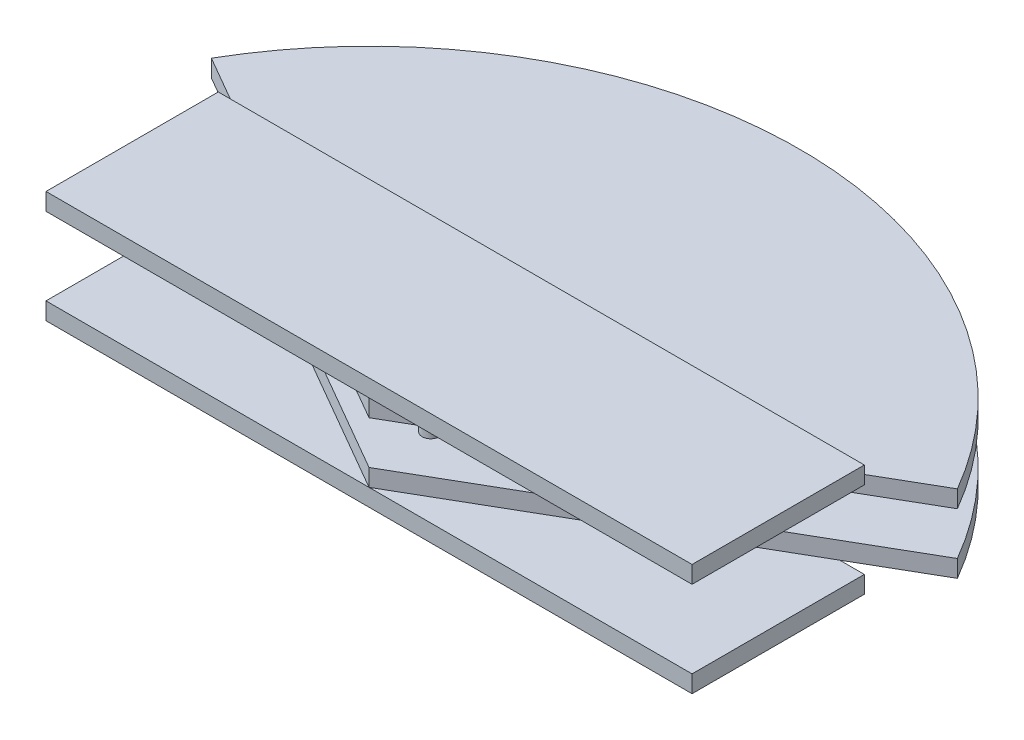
ISO-10303-21;
HEADER;
FILE_DESCRIPTION(('STEP AP214'),'2;1');
FILE_NAME('part.step','',(''),(''),'','','');
FILE_SCHEMA(('AUTOMOTIVE_DESIGN { 1 0 10303 214 1 1 1 1 }'));
ENDSEC;
DATA;
#1=APPLICATION_CONTEXT('core data for automotive mechanical design processes');
#2=APPLICATION_PROTOCOL_DEFINITION('international standard','automotive_design',2000,#1);
#3=PRODUCT_CONTEXT('',#1,'mechanical');
#4=PRODUCT('Part','Part','',(#3));
#5=PRODUCT_RELATED_PRODUCT_CATEGORY('part','',(#4));
#6=PRODUCT_DEFINITION_FORMATION('','',#4);
#7=PRODUCT_DEFINITION_CONTEXT('part definition',#1,'design');
#8=PRODUCT_DEFINITION('design','',#6,#7);
#9=PRODUCT_DEFINITION_SHAPE('','',#8);
#10=(LENGTH_UNIT() NAMED_UNIT(*) SI_UNIT(.MILLI.,.METRE.));
#11=(NAMED_UNIT(*) PLANE_ANGLE_UNIT() SI_UNIT($,.RADIAN.));
#12=(NAMED_UNIT(*) SI_UNIT($,.STERADIAN.) SOLID_ANGLE_UNIT());
#13=UNCERTAINTY_MEASURE_WITH_UNIT(LENGTH_MEASURE(1.E-05),#10,'distance_accuracy_value','');
#14=(GEOMETRIC_REPRESENTATION_CONTEXT(3) GLOBAL_UNCERTAINTY_ASSIGNED_CONTEXT((#13)) GLOBAL_UNIT_ASSIGNED_CONTEXT((#10,
#11,#12)) REPRESENTATION_CONTEXT('',''));
#15=CARTESIAN_POINT('',(0.,0.,0.));
#16=DIRECTION('',(0.,0.,1.));
#17=DIRECTION('',(1.,0.,0.));
#18=AXIS2_PLACEMENT_3D('',#15,#16,#17);
#19=CARTESIAN_POINT('',(0.,8.,0.));
#20=DIRECTION('',(0.499999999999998,0.,-0.86602540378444));
#21=DIRECTION('',(-0.86602540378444,0.,-0.499999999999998));
#22=AXIS2_PLACEMENT_3D('',#19,#20,#21);
#23=PLANE('',#22);
#24=DIRECTION('',(0.86602540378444,0.,0.499999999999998));
#25=VECTOR('',#24,1.);
#26=CARTESIAN_POINT('',(0.,0.,0.));
#27=LINE('',#26,#25);
#28=CARTESIAN_POINT('',(-173.205080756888,0.,-99.9999999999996));
#29=VERTEX_POINT('',#28);
#30=CARTESIAN_POINT('',(0.,0.,0.));
#31=VERTEX_POINT('',#30);
#32=EDGE_CURVE('E274',#29,#31,#27,.T.);
#33=ORIENTED_EDGE('',*,*,#32,.T.);
#34=DIRECTION('',(0.,-1.,0.));
#35=VECTOR('',#34,1.);
#36=CARTESIAN_POINT('',(0.,8.,0.));
#37=LINE('',#36,#35);
#38=CARTESIAN_POINT('',(0.,8.,0.));
#39=VERTEX_POINT('',#38);
#40=EDGE_CURVE('E303',#39,#31,#37,.T.);
#41=ORIENTED_EDGE('',*,*,#40,.F.);
#42=DIRECTION('',(0.86602540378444,0.,0.499999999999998));
#43=VECTOR('',#42,1.);
#44=CARTESIAN_POINT('',(0.,8.,0.));
#45=LINE('',#44,#43);
#46=CARTESIAN_POINT('',(-138.564064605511,8.,-80.));
#47=VERTEX_POINT('',#46);
#48=EDGE_CURVE('E279',#47,#39,#45,.T.);
#49=ORIENTED_EDGE('',*,*,#48,.F.);
#50=CARTESIAN_POINT('',(-173.205080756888,8.,-99.9999999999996));
#51=VERTEX_POINT('',#50);
#52=EDGE_CURVE('E275',#51,#47,#45,.T.);
#53=ORIENTED_EDGE('',*,*,#52,.F.);
#54=DIRECTION('',(0.,-1.,0.));
#55=VECTOR('',#54,1.);
#56=CARTESIAN_POINT('',(-173.205080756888,8.,-99.9999999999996));
#57=LINE('',#56,#55);
#58=EDGE_CURVE('E287',#51,#29,#57,.T.);
#59=ORIENTED_EDGE('',*,*,#58,.T.);
#60=EDGE_LOOP('',(#33,#41,#49,#53,#59));
#61=FACE_BOUND('',#60,.T.);
#62=ADVANCED_FACE('F41',(#61),#23,.F.);
#63=CARTESIAN_POINT('',(0.,8.,0.));
#64=DIRECTION('',(-0.499999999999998,0.,-0.86602540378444));
#65=DIRECTION('',(-0.86602540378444,0.,0.499999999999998));
#66=AXIS2_PLACEMENT_3D('',#63,#64,#65);
#67=PLANE('',#66);
#68=DIRECTION('',(0.86602540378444,0.,-0.499999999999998));
#69=VECTOR('',#68,1.);
#70=CARTESIAN_POINT('',(0.,0.,0.));
#71=LINE('',#70,#69);
#72=CARTESIAN_POINT('',(173.205080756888,0.,-99.9999999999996));
#73=VERTEX_POINT('',#72);
#74=EDGE_CURVE('E291',#31,#73,#71,.T.);
#75=ORIENTED_EDGE('',*,*,#74,.T.);
#76=DIRECTION('',(0.,-1.,0.));
#77=VECTOR('',#76,1.);
#78=CARTESIAN_POINT('',(173.205080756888,8.,-99.9999999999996));
#79=LINE('',#78,#77);
#80=CARTESIAN_POINT('',(173.205080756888,8.,-99.9999999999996));
#81=VERTEX_POINT('',#80);
#82=EDGE_CURVE('E300',#81,#73,#79,.T.);
#83=ORIENTED_EDGE('',*,*,#82,.F.);
#84=DIRECTION('',(0.86602540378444,0.,-0.499999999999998));
#85=VECTOR('',#84,1.);
#86=CARTESIAN_POINT('',(0.,8.,0.));
#87=LINE('',#86,#85);
#88=CARTESIAN_POINT('',(138.564064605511,8.,-80.));
#89=VERTEX_POINT('',#88);
#90=EDGE_CURVE('E278',#89,#81,#87,.T.);
#91=ORIENTED_EDGE('',*,*,#90,.F.);
#92=EDGE_CURVE('E280',#39,#89,#87,.T.);
#93=ORIENTED_EDGE('',*,*,#92,.F.);
#94=ORIENTED_EDGE('',*,*,#40,.T.);
#95=EDGE_LOOP('',(#75,#83,#91,#93,#94));
#96=FACE_BOUND('',#95,.T.);
#97=ADVANCED_FACE('F339',(#96),#67,.F.);
#98=CARTESIAN_POINT('',(0.,8.,0.));
#99=DIRECTION('',(0.,-1.,0.));
#100=DIRECTION('',(0.,0.,-1.));
#101=AXIS2_PLACEMENT_3D('',#98,#99,#100);
#102=CYLINDRICAL_SURFACE('',#101,200.);
#103=CARTESIAN_POINT('',(0.,0.,0.));
#104=DIRECTION('',(0.,1.,0.));
#105=DIRECTION('',(0.,0.,1.));
#106=AXIS2_PLACEMENT_3D('',#103,#104,#105);
#107=CIRCLE('',#106,200.);
#108=EDGE_CURVE('E294',#73,#29,#107,.T.);
#109=ORIENTED_EDGE('',*,*,#108,.T.);
#110=ORIENTED_EDGE('',*,*,#58,.F.);
#111=CARTESIAN_POINT('',(0.,8.,0.));
#112=DIRECTION('',(0.,1.,0.));
#113=DIRECTION('',(0.,0.,1.));
#114=AXIS2_PLACEMENT_3D('',#111,#112,#113);
#115=CIRCLE('',#114,200.);
#116=EDGE_CURVE('E284',#81,#51,#115,.T.);
#117=ORIENTED_EDGE('',*,*,#116,.F.);
#118=ORIENTED_EDGE('',*,*,#82,.T.);
#119=EDGE_LOOP('',(#109,#110,#117,#118));
#120=FACE_BOUND('',#119,.T.);
#121=ADVANCED_FACE('F350',(#120),#102,.T.);
#122=CARTESIAN_POINT('',(0.,8.,0.));
#123=DIRECTION('',(0.,1.,0.));
#124=DIRECTION('',(0.,0.,1.));
#125=AXIS2_PLACEMENT_3D('',#122,#123,#124);
#126=PLANE('',#125);
#127=DIRECTION('',(-1.,0.,0.));
#128=VECTOR('',#127,1.);
#129=CARTESIAN_POINT('',(-150.,8.,-80.));
#130=LINE('',#129,#128);
#131=EDGE_CURVE('E65',#89,#47,#130,.T.);
#132=ORIENTED_EDGE('',*,*,#131,.F.);
#133=ORIENTED_EDGE('',*,*,#90,.T.);
#134=ORIENTED_EDGE('',*,*,#116,.T.);
#135=ORIENTED_EDGE('',*,*,#52,.T.);
#136=EDGE_LOOP('',(#132,#133,#134,#135));
#137=FACE_BOUND('',#136,.T.);
#138=ADVANCED_FACE('F351',(#137),#126,.T.);
#139=CARTESIAN_POINT('',(0.,0.,0.));
#140=DIRECTION('',(0.,1.,0.));
#141=DIRECTION('',(0.,0.,1.));
#142=AXIS2_PLACEMENT_3D('',#139,#140,#141);
#143=PLANE('',#142);
#144=CARTESIAN_POINT('',(0.,0.,-28.6914040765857));
#145=DIRECTION('',(0.,1.,0.));
#146=DIRECTION('',(0.,0.,1.));
#147=AXIS2_PLACEMENT_3D('',#144,#145,#146);
#148=CIRCLE('',#147,4.);
#149=CARTESIAN_POINT('',(0.,0.,-24.6914040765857));
#150=VERTEX_POINT('',#149);
#151=EDGE_CURVE('E44',#150,#150,#148,.F.);
#152=ORIENTED_EDGE('',*,*,#151,.F.);
#153=EDGE_LOOP('',(#152));
#154=FACE_BOUND('',#153,.T.);
#155=ORIENTED_EDGE('',*,*,#32,.F.);
#156=ORIENTED_EDGE('',*,*,#108,.F.);
#157=ORIENTED_EDGE('',*,*,#74,.F.);
#158=EDGE_LOOP('',(#155,#156,#157));
#159=FACE_BOUND('',#158,.T.);
#160=ADVANCED_FACE('F347',(#154,#159),#143,.F.);
#161=CARTESIAN_POINT('',(0.,8.,0.));
#162=DIRECTION('',(0.,-1.,0.));
#163=DIRECTION('',(0.,0.,-1.));
#164=AXIS2_PLACEMENT_3D('',#161,#162,#163);
#165=PLANE('',#164);
#166=CARTESIAN_POINT('',(-150.,8.,-80.));
#167=VERTEX_POINT('',#166);
#168=EDGE_CURVE('E255',#47,#167,#130,.T.);
#169=ORIENTED_EDGE('',*,*,#168,.F.);
#170=ORIENTED_EDGE('',*,*,#48,.T.);
#171=DIRECTION('',(1.,0.,0.));
#172=VECTOR('',#171,1.);
#173=CARTESIAN_POINT('',(-150.,8.,0.));
#174=LINE('',#173,#172);
#175=CARTESIAN_POINT('',(-150.,8.,0.));
#176=VERTEX_POINT('',#175);
#177=EDGE_CURVE('E248',#176,#39,#174,.T.);
#178=ORIENTED_EDGE('',*,*,#177,.F.);
#179=DIRECTION('',(0.,0.,1.));
#180=VECTOR('',#179,1.);
#181=CARTESIAN_POINT('',(-150.,8.,0.));
#182=LINE('',#181,#180);
#183=EDGE_CURVE('E228',#167,#176,#182,.T.);
#184=ORIENTED_EDGE('',*,*,#183,.F.);
#185=EDGE_LOOP('',(#169,#170,#178,#184));
#186=FACE_BOUND('',#185,.T.);
#187=ADVANCED_FACE('F324',(#186),#165,.T.);
#188=CARTESIAN_POINT('',(-150.,16.,0.));
#189=DIRECTION('',(1.,0.,0.));
#190=DIRECTION('',(0.,0.,-1.));
#191=AXIS2_PLACEMENT_3D('',#188,#189,#190);
#192=PLANE('',#191);
#193=ORIENTED_EDGE('',*,*,#183,.T.);
#194=DIRECTION('',(0.,-1.,0.));
#195=VECTOR('',#194,1.);
#196=CARTESIAN_POINT('',(-150.,16.,0.));
#197=LINE('',#196,#195);
#198=CARTESIAN_POINT('',(-150.,16.,0.));
#199=VERTEX_POINT('',#198);
#200=EDGE_CURVE('E270',#199,#176,#197,.T.);
#201=ORIENTED_EDGE('',*,*,#200,.F.);
#202=DIRECTION('',(0.,0.,1.));
#203=VECTOR('',#202,1.);
#204=CARTESIAN_POINT('',(-150.,16.,0.));
#205=LINE('',#204,#203);
#206=CARTESIAN_POINT('',(-150.,16.,-80.));
#207=VERTEX_POINT('',#206);
#208=EDGE_CURVE('E229',#207,#199,#205,.T.);
#209=ORIENTED_EDGE('',*,*,#208,.F.);
#210=DIRECTION('',(0.,-1.,0.));
#211=VECTOR('',#210,1.);
#212=CARTESIAN_POINT('',(-150.,16.,-80.));
#213=LINE('',#212,#211);
#214=EDGE_CURVE('E243',#207,#167,#213,.T.);
#215=ORIENTED_EDGE('',*,*,#214,.T.);
#216=EDGE_LOOP('',(#193,#201,#209,#215));
#217=FACE_BOUND('',#216,.T.);
#218=ADVANCED_FACE('F322',(#217),#192,.F.);
#219=CARTESIAN_POINT('',(-150.,16.,0.));
#220=DIRECTION('',(0.,0.,-1.));
#221=DIRECTION('',(-1.,0.,0.));
#222=AXIS2_PLACEMENT_3D('',#219,#220,#221);
#223=PLANE('',#222);
#224=ORIENTED_EDGE('',*,*,#177,.T.);
#225=CARTESIAN_POINT('',(150.,8.,0.));
#226=VERTEX_POINT('',#225);
#227=EDGE_CURVE('E247',#39,#226,#174,.T.);
#228=ORIENTED_EDGE('',*,*,#227,.T.);
#229=DIRECTION('',(0.,-1.,0.));
#230=VECTOR('',#229,1.);
#231=CARTESIAN_POINT('',(150.,16.,0.));
#232=LINE('',#231,#230);
#233=CARTESIAN_POINT('',(150.,16.,0.));
#234=VERTEX_POINT('',#233);
#235=EDGE_CURVE('E266',#234,#226,#232,.T.);
#236=ORIENTED_EDGE('',*,*,#235,.F.);
#237=DIRECTION('',(1.,0.,0.));
#238=VECTOR('',#237,1.);
#239=CARTESIAN_POINT('',(-150.,16.,0.));
#240=LINE('',#239,#238);
#241=EDGE_CURVE('E233',#199,#234,#240,.T.);
#242=ORIENTED_EDGE('',*,*,#241,.F.);
#243=ORIENTED_EDGE('',*,*,#200,.T.);
#244=EDGE_LOOP('',(#224,#228,#236,#242,#243));
#245=FACE_BOUND('',#244,.T.);
#246=ADVANCED_FACE('F328',(#245),#223,.F.);
#247=CARTESIAN_POINT('',(150.,16.,0.));
#248=DIRECTION('',(-1.,0.,0.));
#249=DIRECTION('',(0.,0.,1.));
#250=AXIS2_PLACEMENT_3D('',#247,#248,#249);
#251=PLANE('',#250);
#252=DIRECTION('',(0.,0.,-1.));
#253=VECTOR('',#252,1.);
#254=CARTESIAN_POINT('',(150.,8.,0.));
#255=LINE('',#254,#253);
#256=CARTESIAN_POINT('',(150.,8.,-80.));
#257=VERTEX_POINT('',#256);
#258=EDGE_CURVE('E252',#226,#257,#255,.T.);
#259=ORIENTED_EDGE('',*,*,#258,.T.);
#260=DIRECTION('',(0.,-1.,0.));
#261=VECTOR('',#260,1.);
#262=CARTESIAN_POINT('',(150.,16.,-80.));
#263=LINE('',#262,#261);
#264=CARTESIAN_POINT('',(150.,16.,-80.));
#265=VERTEX_POINT('',#264);
#266=EDGE_CURVE('E262',#265,#257,#263,.T.);
#267=ORIENTED_EDGE('',*,*,#266,.F.);
#268=DIRECTION('',(0.,0.,-1.));
#269=VECTOR('',#268,1.);
#270=CARTESIAN_POINT('',(150.,16.,0.));
#271=LINE('',#270,#269);
#272=EDGE_CURVE('E237',#234,#265,#271,.T.);
#273=ORIENTED_EDGE('',*,*,#272,.F.);
#274=ORIENTED_EDGE('',*,*,#235,.T.);
#275=EDGE_LOOP('',(#259,#267,#273,#274));
#276=FACE_BOUND('',#275,.T.);
#277=ADVANCED_FACE('F414',(#276),#251,.F.);
#278=CARTESIAN_POINT('',(-150.,16.,-80.));
#279=DIRECTION('',(0.,0.,1.));
#280=DIRECTION('',(1.,0.,0.));
#281=AXIS2_PLACEMENT_3D('',#278,#279,#280);
#282=PLANE('',#281);
#283=EDGE_CURVE('E234',#257,#89,#130,.T.);
#284=ORIENTED_EDGE('',*,*,#283,.T.);
#285=ORIENTED_EDGE('',*,*,#131,.T.);
#286=ORIENTED_EDGE('',*,*,#168,.T.);
#287=ORIENTED_EDGE('',*,*,#214,.F.);
#288=DIRECTION('',(-1.,0.,0.));
#289=VECTOR('',#288,1.);
#290=CARTESIAN_POINT('',(-150.,16.,-80.));
#291=LINE('',#290,#289);
#292=EDGE_CURVE('E240',#265,#207,#291,.T.);
#293=ORIENTED_EDGE('',*,*,#292,.F.);
#294=ORIENTED_EDGE('',*,*,#266,.T.);
#295=EDGE_LOOP('',(#284,#285,#286,#287,#293,#294));
#296=FACE_BOUND('',#295,.T.);
#297=ADVANCED_FACE('F315',(#296),#282,.F.);
#298=CARTESIAN_POINT('',(0.,16.,0.));
#299=DIRECTION('',(0.,-1.,0.));
#300=DIRECTION('',(0.,0.,-1.));
#301=AXIS2_PLACEMENT_3D('',#298,#299,#300);
#302=PLANE('',#301);
#303=ORIENTED_EDGE('',*,*,#208,.T.);
#304=ORIENTED_EDGE('',*,*,#241,.T.);
#305=ORIENTED_EDGE('',*,*,#272,.T.);
#306=ORIENTED_EDGE('',*,*,#292,.T.);
#307=EDGE_LOOP('',(#303,#304,#305,#306));
#308=FACE_BOUND('',#307,.T.);
#309=ADVANCED_FACE('F332',(#308),#302,.F.);
#310=ORIENTED_EDGE('',*,*,#227,.F.);
#311=ORIENTED_EDGE('',*,*,#92,.T.);
#312=ORIENTED_EDGE('',*,*,#283,.F.);
#313=ORIENTED_EDGE('',*,*,#258,.F.);
#314=EDGE_LOOP('',(#310,#311,#312,#313));
#315=FACE_BOUND('',#314,.T.);
#316=ADVANCED_FACE('F338',(#315),#165,.T.);
#317=CARTESIAN_POINT('',(0.,-20.,-28.6914040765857));
#318=DIRECTION('',(0.,1.,0.));
#319=DIRECTION('',(0.,0.,1.));
#320=AXIS2_PLACEMENT_3D('',#317,#318,#319);
#321=CYLINDRICAL_SURFACE('',#320,4.);
#322=CARTESIAN_POINT('',(0.,-20.,-28.6914040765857));
#323=DIRECTION('',(0.,-1.,0.));
#324=DIRECTION('',(0.,0.,-1.));
#325=AXIS2_PLACEMENT_3D('',#322,#323,#324);
#326=CIRCLE('',#325,4.);
#327=CARTESIAN_POINT('',(0.,-20.,-32.6914040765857));
#328=VERTEX_POINT('',#327);
#329=EDGE_CURVE('E224',#328,#328,#326,.T.);
#330=ORIENTED_EDGE('',*,*,#329,.F.);
#331=EDGE_LOOP('',(#330));
#332=FACE_BOUND('',#331,.T.);
#333=ORIENTED_EDGE('',*,*,#151,.T.);
#334=EDGE_LOOP('',(#333));
#335=FACE_BOUND('',#334,.T.);
#336=ADVANCED_FACE('F442',(#332,#335),#321,.T.);
#337=CARTESIAN_POINT('',(0.,-28.,0.));
#338=DIRECTION('',(-0.499999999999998,0.,-0.86602540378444));
#339=DIRECTION('',(-0.86602540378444,0.,0.499999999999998));
#340=AXIS2_PLACEMENT_3D('',#337,#338,#339);
#341=PLANE('',#340);
#342=DIRECTION('',(-0.86602540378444,0.,0.499999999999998));
#343=VECTOR('',#342,1.);
#344=CARTESIAN_POINT('',(0.,-20.,0.));
#345=LINE('',#344,#343);
#346=CARTESIAN_POINT('',(173.205080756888,-20.,-99.9999999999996));
#347=VERTEX_POINT('',#346);
#348=CARTESIAN_POINT('',(0.,-20.,0.));
#349=VERTEX_POINT('',#348);
#350=EDGE_CURVE('E184',#347,#349,#345,.T.);
#351=ORIENTED_EDGE('',*,*,#350,.T.);
#352=DIRECTION('',(0.,1.,0.));
#353=VECTOR('',#352,1.);
#354=CARTESIAN_POINT('',(0.,-28.,0.));
#355=LINE('',#354,#353);
#356=CARTESIAN_POINT('',(0.,-28.,0.));
#357=VERTEX_POINT('',#356);
#358=EDGE_CURVE('E220',#357,#349,#355,.T.);
#359=ORIENTED_EDGE('',*,*,#358,.F.);
#360=DIRECTION('',(-0.86602540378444,0.,0.499999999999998));
#361=VECTOR('',#360,1.);
#362=CARTESIAN_POINT('',(0.,-28.,0.));
#363=LINE('',#362,#361);
#364=CARTESIAN_POINT('',(138.564064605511,-28.,-80.));
#365=VERTEX_POINT('',#364);
#366=EDGE_CURVE('E199',#365,#357,#363,.T.);
#367=ORIENTED_EDGE('',*,*,#366,.F.);
#368=CARTESIAN_POINT('',(173.205080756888,-28.,-99.9999999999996));
#369=VERTEX_POINT('',#368);
#370=EDGE_CURVE('E195',#369,#365,#363,.T.);
#371=ORIENTED_EDGE('',*,*,#370,.F.);
#372=DIRECTION('',(0.,1.,0.));
#373=VECTOR('',#372,1.);
#374=CARTESIAN_POINT('',(173.205080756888,-28.,-99.9999999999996));
#375=LINE('',#374,#373);
#376=EDGE_CURVE('E206',#369,#347,#375,.T.);
#377=ORIENTED_EDGE('',*,*,#376,.T.);
#378=EDGE_LOOP('',(#351,#359,#367,#371,#377));
#379=FACE_BOUND('',#378,.T.);
#380=ADVANCED_FACE('F448',(#379),#341,.F.);
#381=CARTESIAN_POINT('',(0.,-28.,0.));
#382=DIRECTION('',(0.499999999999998,0.,-0.86602540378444));
#383=DIRECTION('',(-0.86602540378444,0.,-0.499999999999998));
#384=AXIS2_PLACEMENT_3D('',#381,#382,#383);
#385=PLANE('',#384);
#386=DIRECTION('',(-0.86602540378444,0.,-0.499999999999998));
#387=VECTOR('',#386,1.);
#388=CARTESIAN_POINT('',(0.,-20.,0.));
#389=LINE('',#388,#387);
#390=CARTESIAN_POINT('',(-173.205080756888,-20.,-99.9999999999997));
#391=VERTEX_POINT('',#390);
#392=EDGE_CURVE('E189',#349,#391,#389,.T.);
#393=ORIENTED_EDGE('',*,*,#392,.T.);
#394=DIRECTION('',(0.,1.,0.));
#395=VECTOR('',#394,1.);
#396=CARTESIAN_POINT('',(-173.205080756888,-28.,-99.9999999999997));
#397=LINE('',#396,#395);
#398=CARTESIAN_POINT('',(-173.205080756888,-28.,-99.9999999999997));
#399=VERTEX_POINT('',#398);
#400=EDGE_CURVE('E216',#399,#391,#397,.T.);
#401=ORIENTED_EDGE('',*,*,#400,.F.);
#402=DIRECTION('',(-0.86602540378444,0.,-0.499999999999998));
#403=VECTOR('',#402,1.);
#404=CARTESIAN_POINT('',(0.,-28.,0.));
#405=LINE('',#404,#403);
#406=CARTESIAN_POINT('',(-138.564064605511,-28.,-80.));
#407=VERTEX_POINT('',#406);
#408=EDGE_CURVE('E198',#407,#399,#405,.T.);
#409=ORIENTED_EDGE('',*,*,#408,.F.);
#410=EDGE_CURVE('E200',#357,#407,#405,.T.);
#411=ORIENTED_EDGE('',*,*,#410,.F.);
#412=ORIENTED_EDGE('',*,*,#358,.T.);
#413=EDGE_LOOP('',(#393,#401,#409,#411,#412));
#414=FACE_BOUND('',#413,.T.);
#415=ADVANCED_FACE('F458',(#414),#385,.F.);
#416=CARTESIAN_POINT('',(0.,-28.,0.));
#417=DIRECTION('',(0.,1.,0.));
#418=DIRECTION('',(0.,0.,1.));
#419=AXIS2_PLACEMENT_3D('',#416,#417,#418);
#420=CYLINDRICAL_SURFACE('',#419,200.);
#421=CARTESIAN_POINT('',(0.,-20.,0.));
#422=DIRECTION('',(0.,-1.,0.));
#423=DIRECTION('',(0.,0.,-1.));
#424=AXIS2_PLACEMENT_3D('',#421,#422,#423);
#425=CIRCLE('',#424,200.);
#426=EDGE_CURVE('E210',#391,#347,#425,.T.);
#427=ORIENTED_EDGE('',*,*,#426,.T.);
#428=ORIENTED_EDGE('',*,*,#376,.F.);
#429=CARTESIAN_POINT('',(0.,-28.,0.));
#430=DIRECTION('',(0.,-1.,0.));
#431=DIRECTION('',(0.,0.,-1.));
#432=AXIS2_PLACEMENT_3D('',#429,#430,#431);
#433=CIRCLE('',#432,200.);
#434=EDGE_CURVE('E204',#399,#369,#433,.T.);
#435=ORIENTED_EDGE('',*,*,#434,.F.);
#436=ORIENTED_EDGE('',*,*,#400,.T.);
#437=EDGE_LOOP('',(#427,#428,#435,#436));
#438=FACE_BOUND('',#437,.T.);
#439=ADVANCED_FACE('F468',(#438),#420,.T.);
#440=CARTESIAN_POINT('',(0.,-28.,0.));
#441=DIRECTION('',(0.,-1.,0.));
#442=DIRECTION('',(0.,0.,-1.));
#443=AXIS2_PLACEMENT_3D('',#440,#441,#442);
#444=PLANE('',#443);
#445=DIRECTION('',(1.,0.,0.));
#446=VECTOR('',#445,1.);
#447=CARTESIAN_POINT('',(-150.,-28.,-80.));
#448=LINE('',#447,#446);
#449=EDGE_CURVE('E11',#407,#365,#448,.T.);
#450=ORIENTED_EDGE('',*,*,#449,.F.);
#451=ORIENTED_EDGE('',*,*,#408,.T.);
#452=ORIENTED_EDGE('',*,*,#434,.T.);
#453=ORIENTED_EDGE('',*,*,#370,.T.);
#454=EDGE_LOOP('',(#450,#451,#452,#453));
#455=FACE_BOUND('',#454,.T.);
#456=ADVANCED_FACE('F477',(#455),#444,.T.);
#457=CARTESIAN_POINT('',(0.,-20.,0.));
#458=DIRECTION('',(0.,-1.,0.));
#459=DIRECTION('',(0.,0.,-1.));
#460=AXIS2_PLACEMENT_3D('',#457,#458,#459);
#461=PLANE('',#460);
#462=ORIENTED_EDGE('',*,*,#329,.T.);
#463=EDGE_LOOP('',(#462));
#464=FACE_BOUND('',#463,.T.);
#465=ORIENTED_EDGE('',*,*,#350,.F.);
#466=ORIENTED_EDGE('',*,*,#426,.F.);
#467=ORIENTED_EDGE('',*,*,#392,.F.);
#468=EDGE_LOOP('',(#465,#466,#467));
#469=FACE_BOUND('',#468,.T.);
#470=ADVANCED_FACE('F485',(#464,#469),#461,.F.);
#471=CARTESIAN_POINT('',(0.,-28.,0.));
#472=DIRECTION('',(0.,1.,0.));
#473=DIRECTION('',(0.,0.,1.));
#474=AXIS2_PLACEMENT_3D('',#471,#472,#473);
#475=PLANE('',#474);
#476=CARTESIAN_POINT('',(150.,-28.,-80.));
#477=VERTEX_POINT('',#476);
#478=EDGE_CURVE('E52',#365,#477,#448,.T.);
#479=ORIENTED_EDGE('',*,*,#478,.F.);
#480=ORIENTED_EDGE('',*,*,#366,.T.);
#481=DIRECTION('',(-1.,0.,0.));
#482=VECTOR('',#481,1.);
#483=CARTESIAN_POINT('',(-150.,-28.,0.));
#484=LINE('',#483,#482);
#485=CARTESIAN_POINT('',(150.,-28.,0.));
#486=VERTEX_POINT('',#485);
#487=EDGE_CURVE('E178',#486,#357,#484,.T.);
#488=ORIENTED_EDGE('',*,*,#487,.F.);
#489=DIRECTION('',(0.,0.,1.));
#490=VECTOR('',#489,1.);
#491=CARTESIAN_POINT('',(150.,-28.,-80.));
#492=LINE('',#491,#490);
#493=EDGE_CURVE('E575',#477,#486,#492,.T.);
#494=ORIENTED_EDGE('',*,*,#493,.F.);
#495=EDGE_LOOP('',(#479,#480,#488,#494));
#496=FACE_BOUND('',#495,.T.);
#497=ADVANCED_FACE('F493',(#496),#475,.T.);
#498=CARTESIAN_POINT('',(-150.,-36.,-80.));
#499=DIRECTION('',(1.,0.,0.));
#500=DIRECTION('',(0.,0.,-1.));
#501=AXIS2_PLACEMENT_3D('',#498,#499,#500);
#502=PLANE('',#501);
#503=DIRECTION('',(0.,0.,-1.));
#504=VECTOR('',#503,1.);
#505=CARTESIAN_POINT('',(-150.,-28.,-80.));
#506=LINE('',#505,#504);
#507=CARTESIAN_POINT('',(-150.,-28.,0.));
#508=VERTEX_POINT('',#507);
#509=CARTESIAN_POINT('',(-150.,-28.,-80.));
#510=VERTEX_POINT('',#509);
#511=EDGE_CURVE('E182',#508,#510,#506,.T.);
#512=ORIENTED_EDGE('',*,*,#511,.T.);
#513=DIRECTION('',(0.,1.,0.));
#514=VECTOR('',#513,1.);
#515=CARTESIAN_POINT('',(-150.,-36.,-80.));
#516=LINE('',#515,#514);
#517=CARTESIAN_POINT('',(-150.,-36.,-80.));
#518=VERTEX_POINT('',#517);
#519=EDGE_CURVE('E160',#518,#510,#516,.T.);
#520=ORIENTED_EDGE('',*,*,#519,.F.);
#521=DIRECTION('',(0.,0.,-1.));
#522=VECTOR('',#521,1.);
#523=CARTESIAN_POINT('',(-150.,-36.,-80.));
#524=LINE('',#523,#522);
#525=CARTESIAN_POINT('',(-150.,-36.,0.));
#526=VERTEX_POINT('',#525);
#527=EDGE_CURVE('E168',#526,#518,#524,.T.);
#528=ORIENTED_EDGE('',*,*,#527,.F.);
#529=DIRECTION('',(0.,1.,0.));
#530=VECTOR('',#529,1.);
#531=CARTESIAN_POINT('',(-150.,-36.,0.));
#532=LINE('',#531,#530);
#533=EDGE_CURVE('E585',#526,#508,#532,.T.);
#534=ORIENTED_EDGE('',*,*,#533,.T.);
#535=EDGE_LOOP('',(#512,#520,#528,#534));
#536=FACE_BOUND('',#535,.T.);
#537=ADVANCED_FACE('F180',(#536),#502,.F.);
#538=CARTESIAN_POINT('',(-150.,-36.,-80.));
#539=DIRECTION('',(0.,0.,1.));
#540=DIRECTION('',(1.,0.,0.));
#541=AXIS2_PLACEMENT_3D('',#538,#539,#540);
#542=PLANE('',#541);
#543=EDGE_CURVE('E51',#510,#407,#448,.T.);
#544=ORIENTED_EDGE('',*,*,#543,.T.);
#545=ORIENTED_EDGE('',*,*,#449,.T.);
#546=ORIENTED_EDGE('',*,*,#478,.T.);
#547=DIRECTION('',(0.,1.,0.));
#548=VECTOR('',#547,1.);
#549=CARTESIAN_POINT('',(150.,-36.,-80.));
#550=LINE('',#549,#548);
#551=CARTESIAN_POINT('',(150.,-36.,-80.));
#552=VERTEX_POINT('',#551);
#553=EDGE_CURVE('E163',#552,#477,#550,.T.);
#554=ORIENTED_EDGE('',*,*,#553,.F.);
#555=DIRECTION('',(1.,0.,0.));
#556=VECTOR('',#555,1.);
#557=CARTESIAN_POINT('',(-150.,-36.,-80.));
#558=LINE('',#557,#556);
#559=EDGE_CURVE('E155',#518,#552,#558,.T.);
#560=ORIENTED_EDGE('',*,*,#559,.F.);
#561=ORIENTED_EDGE('',*,*,#519,.T.);
#562=EDGE_LOOP('',(#544,#545,#546,#554,#560,#561));
#563=FACE_BOUND('',#562,.T.);
#564=ADVANCED_FACE('F158',(#563),#542,.F.);
#565=CARTESIAN_POINT('',(150.,-36.,-80.));
#566=DIRECTION('',(-1.,0.,0.));
#567=DIRECTION('',(0.,0.,1.));
#568=AXIS2_PLACEMENT_3D('',#565,#566,#567);
#569=PLANE('',#568);
#570=ORIENTED_EDGE('',*,*,#493,.T.);
#571=DIRECTION('',(0.,1.,0.));
#572=VECTOR('',#571,1.);
#573=CARTESIAN_POINT('',(150.,-36.,0.));
#574=LINE('',#573,#572);
#575=CARTESIAN_POINT('',(150.,-36.,0.));
#576=VERTEX_POINT('',#575);
#577=EDGE_CURVE('E191',#576,#486,#574,.T.);
#578=ORIENTED_EDGE('',*,*,#577,.F.);
#579=DIRECTION('',(0.,0.,1.));
#580=VECTOR('',#579,1.);
#581=CARTESIAN_POINT('',(150.,-36.,-80.));
#582=LINE('',#581,#580);
#583=EDGE_CURVE('E167',#552,#576,#582,.T.);
#584=ORIENTED_EDGE('',*,*,#583,.F.);
#585=ORIENTED_EDGE('',*,*,#553,.T.);
#586=EDGE_LOOP('',(#570,#578,#584,#585));
#587=FACE_BOUND('',#586,.T.);
#588=ADVANCED_FACE('F517',(#587),#569,.F.);
#589=CARTESIAN_POINT('',(-150.,-36.,0.));
#590=DIRECTION('',(0.,0.,-1.));
#591=DIRECTION('',(-1.,0.,0.));
#592=AXIS2_PLACEMENT_3D('',#589,#590,#591);
#593=PLANE('',#592);
#594=ORIENTED_EDGE('',*,*,#487,.T.);
#595=EDGE_CURVE('E572',#357,#508,#484,.T.);
#596=ORIENTED_EDGE('',*,*,#595,.T.);
#597=ORIENTED_EDGE('',*,*,#533,.F.);
#598=DIRECTION('',(-1.,0.,0.));
#599=VECTOR('',#598,1.);
#600=CARTESIAN_POINT('',(-150.,-36.,0.));
#601=LINE('',#600,#599);
#602=EDGE_CURVE('E173',#576,#526,#601,.T.);
#603=ORIENTED_EDGE('',*,*,#602,.F.);
#604=ORIENTED_EDGE('',*,*,#577,.T.);
#605=EDGE_LOOP('',(#594,#596,#597,#603,#604));
#606=FACE_BOUND('',#605,.T.);
#607=ADVANCED_FACE('F525',(#606),#593,.F.);
#608=CARTESIAN_POINT('',(0.,-36.,0.));
#609=DIRECTION('',(0.,1.,0.));
#610=DIRECTION('',(0.,0.,1.));
#611=AXIS2_PLACEMENT_3D('',#608,#609,#610);
#612=PLANE('',#611);
#613=ORIENTED_EDGE('',*,*,#527,.T.);
#614=ORIENTED_EDGE('',*,*,#559,.T.);
#615=ORIENTED_EDGE('',*,*,#583,.T.);
#616=ORIENTED_EDGE('',*,*,#602,.T.);
#617=EDGE_LOOP('',(#613,#614,#615,#616));
#618=FACE_BOUND('',#617,.T.);
#619=ADVANCED_FACE('F171',(#618),#612,.F.);
#620=ORIENTED_EDGE('',*,*,#595,.F.);
#621=ORIENTED_EDGE('',*,*,#410,.T.);
#622=ORIENTED_EDGE('',*,*,#543,.F.);
#623=ORIENTED_EDGE('',*,*,#511,.F.);
#624=EDGE_LOOP('',(#620,#621,#622,#623));
#625=FACE_BOUND('',#624,.T.);
#626=ADVANCED_FACE('F503',(#625),#475,.T.);
#627=CLOSED_SHELL('',(#62,#97,#121,#138,#160,#187,#218,#246,#277,#297,#309,#316,#336,#380,#415,
#439,#456,#470,#497,#537,#564,#588,#607,#619,#626));
#628=MANIFOLD_SOLID_BREP('B2',#627);
#629=ADVANCED_BREP_SHAPE_REPRESENTATION('',(#18,#628),#14);
#630=SHAPE_DEFINITION_REPRESENTATION(#9,#629);
ENDSEC;
END-ISO-10303-21;
